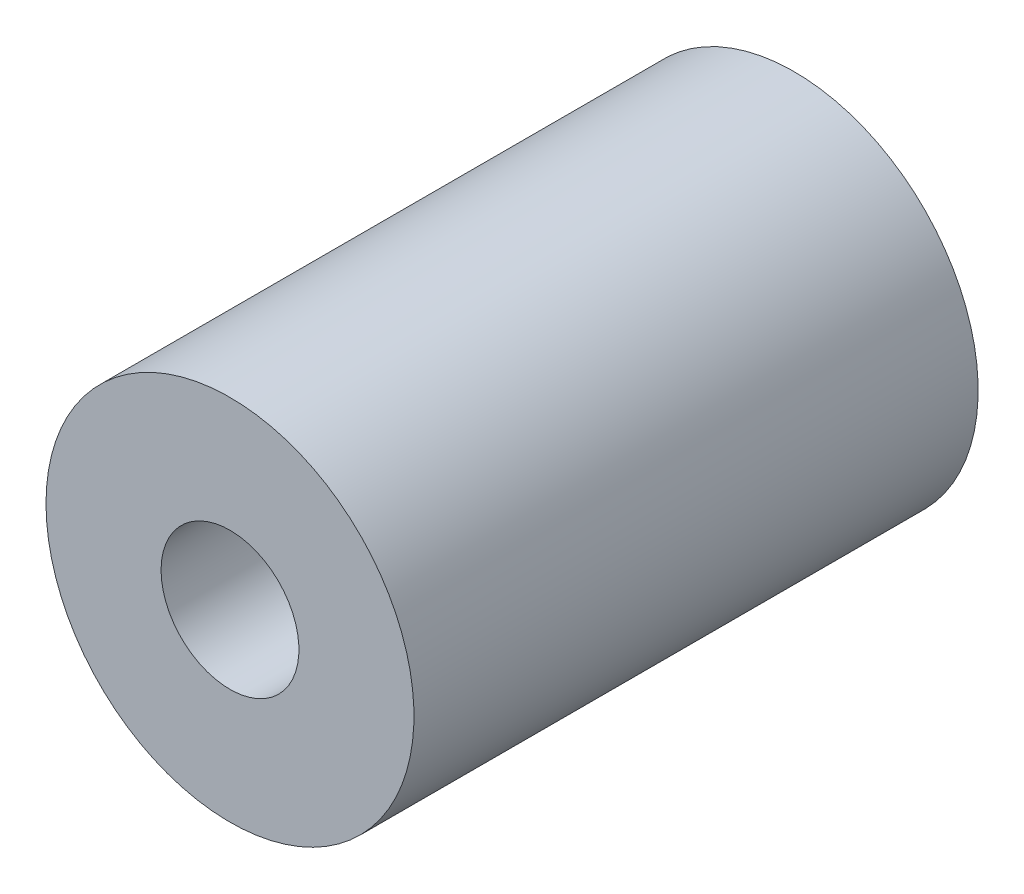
ISO-10303-21;
HEADER;
FILE_DESCRIPTION(('STEP AP214'),'2;1');
FILE_NAME('part.step','',(''),(''),'','','');
FILE_SCHEMA(('AUTOMOTIVE_DESIGN { 1 0 10303 214 1 1 1 1 }'));
ENDSEC;
DATA;
#1=APPLICATION_CONTEXT('core data for automotive mechanical design processes');
#2=APPLICATION_PROTOCOL_DEFINITION('international standard','automotive_design',2000,#1);
#3=PRODUCT_CONTEXT('',#1,'mechanical');
#4=PRODUCT('Part','Part','',(#3));
#5=PRODUCT_RELATED_PRODUCT_CATEGORY('part','',(#4));
#6=PRODUCT_DEFINITION_FORMATION('','',#4);
#7=PRODUCT_DEFINITION_CONTEXT('part definition',#1,'design');
#8=PRODUCT_DEFINITION('design','',#6,#7);
#9=PRODUCT_DEFINITION_SHAPE('','',#8);
#10=(LENGTH_UNIT() NAMED_UNIT(*) SI_UNIT(.MILLI.,.METRE.));
#11=(NAMED_UNIT(*) PLANE_ANGLE_UNIT() SI_UNIT($,.RADIAN.));
#12=(NAMED_UNIT(*) SI_UNIT($,.STERADIAN.) SOLID_ANGLE_UNIT());
#13=UNCERTAINTY_MEASURE_WITH_UNIT(LENGTH_MEASURE(1.E-05),#10,'distance_accuracy_value','');
#14=(GEOMETRIC_REPRESENTATION_CONTEXT(3) GLOBAL_UNCERTAINTY_ASSIGNED_CONTEXT((#13)) GLOBAL_UNIT_ASSIGNED_CONTEXT((#10,
#11,#12)) REPRESENTATION_CONTEXT('',''));
#15=CARTESIAN_POINT('',(0.,0.,0.));
#16=DIRECTION('',(0.,0.,1.));
#17=DIRECTION('',(1.,0.,0.));
#18=AXIS2_PLACEMENT_3D('',#15,#16,#17);
#19=CARTESIAN_POINT('',(0.,0.,29.21));
#20=DIRECTION('',(0.,0.,1.));
#21=DIRECTION('',(1.,0.,0.));
#22=AXIS2_PLACEMENT_3D('',#19,#20,#21);
#23=PLANE('',#22);
#24=CARTESIAN_POINT('',(0.,0.,29.21));
#25=DIRECTION('',(0.,0.,1.));
#26=DIRECTION('',(1.,0.,0.));
#27=AXIS2_PLACEMENT_3D('',#24,#25,#26);
#28=CIRCLE('',#27,9.525);
#29=CARTESIAN_POINT('',(-9.525,0.,29.21));
#30=VERTEX_POINT('',#29);
#31=EDGE_CURVE('E10',#30,#30,#28,.T.);
#32=ORIENTED_EDGE('',*,*,#31,.T.);
#33=EDGE_LOOP('',(#32));
#34=FACE_BOUND('',#33,.T.);
#35=CARTESIAN_POINT('',(0.,0.,29.21));
#36=DIRECTION('',(0.,0.,1.));
#37=DIRECTION('',(1.,0.,0.));
#38=AXIS2_PLACEMENT_3D('',#35,#36,#37);
#39=CIRCLE('',#38,3.5687);
#40=CARTESIAN_POINT('',(-3.5687,0.,29.21));
#41=VERTEX_POINT('',#40);
#42=EDGE_CURVE('E389',#41,#41,#39,.T.);
#43=ORIENTED_EDGE('',*,*,#42,.F.);
#44=EDGE_LOOP('',(#43));
#45=FACE_BOUND('',#44,.T.);
#46=ADVANCED_FACE('F378',(#34,#45),#23,.T.);
#47=CARTESIAN_POINT('',(0.,0.,0.));
#48=DIRECTION('',(0.,0.,1.));
#49=DIRECTION('',(1.,0.,0.));
#50=AXIS2_PLACEMENT_3D('',#47,#48,#49);
#51=PLANE('',#50);
#52=CARTESIAN_POINT('',(0.,0.,0.));
#53=DIRECTION('',(0.,0.,1.));
#54=DIRECTION('',(1.,0.,0.));
#55=AXIS2_PLACEMENT_3D('',#52,#53,#54);
#56=CIRCLE('',#55,9.525);
#57=CARTESIAN_POINT('',(-9.525,0.,0.));
#58=VERTEX_POINT('',#57);
#59=EDGE_CURVE('E385',#58,#58,#56,.T.);
#60=ORIENTED_EDGE('',*,*,#59,.F.);
#61=EDGE_LOOP('',(#60));
#62=FACE_BOUND('',#61,.T.);
#63=CARTESIAN_POINT('',(0.,0.,0.));
#64=DIRECTION('',(0.,0.,1.));
#65=DIRECTION('',(1.,0.,0.));
#66=AXIS2_PLACEMENT_3D('',#63,#64,#65);
#67=CIRCLE('',#66,3.5687);
#68=CARTESIAN_POINT('',(-3.5687,0.,0.));
#69=VERTEX_POINT('',#68);
#70=EDGE_CURVE('E393',#69,#69,#67,.T.);
#71=ORIENTED_EDGE('',*,*,#70,.T.);
#72=EDGE_LOOP('',(#71));
#73=FACE_BOUND('',#72,.T.);
#74=ADVANCED_FACE('F399',(#62,#73),#51,.F.);
#75=CARTESIAN_POINT('',(0.,0.,29.21));
#76=DIRECTION('',(0.,0.,-1.));
#77=DIRECTION('',(-1.,0.,0.));
#78=AXIS2_PLACEMENT_3D('',#75,#76,#77);
#79=CYLINDRICAL_SURFACE('',#78,9.525);
#80=CARTESIAN_POINT('',(-9.525,0.,29.21));
#81=CARTESIAN_POINT('',(-9.525,0.,28.9057291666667));
#82=CARTESIAN_POINT('',(-9.525,0.,28.6014583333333));
#83=CARTESIAN_POINT('',(-9.525,0.,27.9929166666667));
#84=CARTESIAN_POINT('',(-9.525,0.,27.6886458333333));
#85=CARTESIAN_POINT('',(-9.525,0.,27.0801041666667));
#86=CARTESIAN_POINT('',(-9.525,0.,26.7758333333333));
#87=CARTESIAN_POINT('',(-9.525,0.,26.1672916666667));
#88=CARTESIAN_POINT('',(-9.525,0.,25.8630208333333));
#89=CARTESIAN_POINT('',(-9.525,0.,25.2544791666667));
#90=CARTESIAN_POINT('',(-9.525,0.,24.9502083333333));
#91=CARTESIAN_POINT('',(-9.525,0.,24.3416666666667));
#92=CARTESIAN_POINT('',(-9.525,0.,24.0373958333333));
#93=CARTESIAN_POINT('',(-9.525,0.,23.4288541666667));
#94=CARTESIAN_POINT('',(-9.525,0.,23.1245833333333));
#95=CARTESIAN_POINT('',(-9.525,0.,22.5160416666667));
#96=CARTESIAN_POINT('',(-9.525,0.,22.2117708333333));
#97=CARTESIAN_POINT('',(-9.525,0.,21.6032291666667));
#98=CARTESIAN_POINT('',(-9.525,0.,21.2989583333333));
#99=CARTESIAN_POINT('',(-9.525,0.,20.6904166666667));
#100=CARTESIAN_POINT('',(-9.525,0.,20.3861458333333));
#101=CARTESIAN_POINT('',(-9.525,0.,19.7776041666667));
#102=CARTESIAN_POINT('',(-9.525,0.,19.4733333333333));
#103=CARTESIAN_POINT('',(-9.525,0.,18.8647916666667));
#104=CARTESIAN_POINT('',(-9.525,0.,18.5605208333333));
#105=CARTESIAN_POINT('',(-9.525,0.,17.9519791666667));
#106=CARTESIAN_POINT('',(-9.525,0.,17.6477083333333));
#107=CARTESIAN_POINT('',(-9.525,0.,17.0391666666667));
#108=CARTESIAN_POINT('',(-9.525,0.,16.7348958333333));
#109=CARTESIAN_POINT('',(-9.525,0.,16.1263541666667));
#110=CARTESIAN_POINT('',(-9.525,0.,15.8220833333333));
#111=CARTESIAN_POINT('',(-9.525,0.,15.2135416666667));
#112=CARTESIAN_POINT('',(-9.525,0.,14.9092708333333));
#113=CARTESIAN_POINT('',(-9.525,0.,14.3007291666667));
#114=CARTESIAN_POINT('',(-9.525,0.,13.9964583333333));
#115=CARTESIAN_POINT('',(-9.525,0.,13.3879166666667));
#116=CARTESIAN_POINT('',(-9.525,0.,13.0836458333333));
#117=CARTESIAN_POINT('',(-9.525,0.,12.4751041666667));
#118=CARTESIAN_POINT('',(-9.525,0.,12.1708333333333));
#119=CARTESIAN_POINT('',(-9.525,0.,11.5622916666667));
#120=CARTESIAN_POINT('',(-9.525,0.,11.2580208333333));
#121=CARTESIAN_POINT('',(-9.525,0.,10.6494791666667));
#122=CARTESIAN_POINT('',(-9.525,0.,10.3452083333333));
#123=CARTESIAN_POINT('',(-9.525,0.,9.73666666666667));
#124=CARTESIAN_POINT('',(-9.525,0.,9.43239583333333));
#125=CARTESIAN_POINT('',(-9.525,0.,8.82385416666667));
#126=CARTESIAN_POINT('',(-9.525,0.,8.51958333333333));
#127=CARTESIAN_POINT('',(-9.525,0.,7.91104166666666));
#128=CARTESIAN_POINT('',(-9.525,0.,7.60677083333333));
#129=CARTESIAN_POINT('',(-9.525,0.,6.99822916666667));
#130=CARTESIAN_POINT('',(-9.525,0.,6.69395833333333));
#131=CARTESIAN_POINT('',(-9.525,0.,6.08541666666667));
#132=CARTESIAN_POINT('',(-9.525,0.,5.78114583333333));
#133=CARTESIAN_POINT('',(-9.525,0.,5.17260416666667));
#134=CARTESIAN_POINT('',(-9.525,0.,4.86833333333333));
#135=CARTESIAN_POINT('',(-9.525,0.,4.25979166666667));
#136=CARTESIAN_POINT('',(-9.525,0.,3.95552083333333));
#137=CARTESIAN_POINT('',(-9.525,0.,3.34697916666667));
#138=CARTESIAN_POINT('',(-9.525,0.,3.04270833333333));
#139=CARTESIAN_POINT('',(-9.525,0.,2.43416666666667));
#140=CARTESIAN_POINT('',(-9.525,0.,2.12989583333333));
#141=CARTESIAN_POINT('',(-9.525,0.,1.52135416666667));
#142=CARTESIAN_POINT('',(-9.525,0.,1.21708333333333));
#143=CARTESIAN_POINT('',(-9.525,0.,0.608541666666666));
#144=CARTESIAN_POINT('',(-9.525,0.,0.304270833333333));
#145=CARTESIAN_POINT('',(-9.525,0.,0.));
#146=B_SPLINE_CURVE_WITH_KNOTS('',3,(#80,#81,#82,#83,#84,#85,#86,#87,#88,#89,#90,#91,#92,#93,
#94,#95,#96,#97,#98,#99,#100,#101,#102,#103,#104,#105,#106,#107,#108,#109,#110,#111,#112,#113,
#114,#115,#116,#117,#118,#119,#120,#121,#122,#123,#124,#125,#126,#127,#128,#129,#130,#131,#132,
#133,#134,#135,#136,#137,#138,#139,#140,#141,#142,#143,#144,#145),.UNSPECIFIED.,.F.,.F.,(4,2,2,
2,2,2,2,2,2,2,2,2,2,2,2,2,2,2,2,2,2,2,2,2,2,2,2,2,2,2,2,2,4),(0.,0.912812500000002,1.825625,
2.7384375,3.65125,4.5640625,5.476875,6.3896875,7.3025,8.2153125,9.128125,10.0409375,10.95375,
11.8665625,12.779375,13.6921875,14.605,15.5178125,16.430625,17.3434375,18.25625,19.1690625,
20.081875,20.9946875,21.9075,22.8203125,23.733125,24.6459375,25.55875,26.4715625,27.384375,
28.2971875,29.21),.UNSPECIFIED.);
#147=EDGE_CURVE('BSEAM380',#30,#58,#146,.T.);
#148=ORIENTED_EDGE('',*,*,#31,.F.);
#149=ORIENTED_EDGE('',*,*,#59,.T.);
#150=ORIENTED_EDGE('',*,*,#147,.T.);
#151=ORIENTED_EDGE('',*,*,#147,.F.);
#152=EDGE_LOOP('',(#148,#150,#149,#151));
#153=FACE_BOUND('',#152,.T.);
#154=ADVANCED_FACE('F380',(#153),#79,.T.);
#155=CARTESIAN_POINT('',(0.,0.,29.21));
#156=DIRECTION('',(0.,0.,-1.));
#157=DIRECTION('',(-1.,0.,0.));
#158=AXIS2_PLACEMENT_3D('',#155,#156,#157);
#159=CYLINDRICAL_SURFACE('',#158,3.5687);
#160=CARTESIAN_POINT('',(-3.5687,0.,29.21));
#161=CARTESIAN_POINT('',(-3.5687,0.,28.9057291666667));
#162=CARTESIAN_POINT('',(-3.5687,0.,28.6014583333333));
#163=CARTESIAN_POINT('',(-3.5687,0.,27.9929166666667));
#164=CARTESIAN_POINT('',(-3.5687,0.,27.6886458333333));
#165=CARTESIAN_POINT('',(-3.5687,0.,27.0801041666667));
#166=CARTESIAN_POINT('',(-3.5687,0.,26.7758333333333));
#167=CARTESIAN_POINT('',(-3.5687,0.,26.1672916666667));
#168=CARTESIAN_POINT('',(-3.5687,0.,25.8630208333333));
#169=CARTESIAN_POINT('',(-3.5687,0.,25.2544791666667));
#170=CARTESIAN_POINT('',(-3.5687,0.,24.9502083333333));
#171=CARTESIAN_POINT('',(-3.5687,0.,24.3416666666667));
#172=CARTESIAN_POINT('',(-3.5687,0.,24.0373958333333));
#173=CARTESIAN_POINT('',(-3.5687,0.,23.4288541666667));
#174=CARTESIAN_POINT('',(-3.5687,0.,23.1245833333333));
#175=CARTESIAN_POINT('',(-3.5687,0.,22.5160416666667));
#176=CARTESIAN_POINT('',(-3.5687,0.,22.2117708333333));
#177=CARTESIAN_POINT('',(-3.5687,0.,21.6032291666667));
#178=CARTESIAN_POINT('',(-3.5687,0.,21.2989583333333));
#179=CARTESIAN_POINT('',(-3.5687,0.,20.6904166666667));
#180=CARTESIAN_POINT('',(-3.5687,0.,20.3861458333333));
#181=CARTESIAN_POINT('',(-3.5687,0.,19.7776041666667));
#182=CARTESIAN_POINT('',(-3.5687,0.,19.4733333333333));
#183=CARTESIAN_POINT('',(-3.5687,0.,18.8647916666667));
#184=CARTESIAN_POINT('',(-3.5687,0.,18.5605208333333));
#185=CARTESIAN_POINT('',(-3.5687,0.,17.9519791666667));
#186=CARTESIAN_POINT('',(-3.5687,0.,17.6477083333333));
#187=CARTESIAN_POINT('',(-3.5687,0.,17.0391666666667));
#188=CARTESIAN_POINT('',(-3.5687,0.,16.7348958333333));
#189=CARTESIAN_POINT('',(-3.5687,0.,16.1263541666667));
#190=CARTESIAN_POINT('',(-3.5687,0.,15.8220833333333));
#191=CARTESIAN_POINT('',(-3.5687,0.,15.2135416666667));
#192=CARTESIAN_POINT('',(-3.5687,0.,14.9092708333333));
#193=CARTESIAN_POINT('',(-3.5687,0.,14.3007291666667));
#194=CARTESIAN_POINT('',(-3.5687,0.,13.9964583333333));
#195=CARTESIAN_POINT('',(-3.5687,0.,13.3879166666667));
#196=CARTESIAN_POINT('',(-3.5687,0.,13.0836458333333));
#197=CARTESIAN_POINT('',(-3.5687,0.,12.4751041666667));
#198=CARTESIAN_POINT('',(-3.5687,0.,12.1708333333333));
#199=CARTESIAN_POINT('',(-3.5687,0.,11.5622916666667));
#200=CARTESIAN_POINT('',(-3.5687,0.,11.2580208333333));
#201=CARTESIAN_POINT('',(-3.5687,0.,10.6494791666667));
#202=CARTESIAN_POINT('',(-3.5687,0.,10.3452083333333));
#203=CARTESIAN_POINT('',(-3.5687,0.,9.73666666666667));
#204=CARTESIAN_POINT('',(-3.5687,0.,9.43239583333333));
#205=CARTESIAN_POINT('',(-3.5687,0.,8.82385416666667));
#206=CARTESIAN_POINT('',(-3.5687,0.,8.51958333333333));
#207=CARTESIAN_POINT('',(-3.5687,0.,7.91104166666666));
#208=CARTESIAN_POINT('',(-3.5687,0.,7.60677083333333));
#209=CARTESIAN_POINT('',(-3.5687,0.,6.99822916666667));
#210=CARTESIAN_POINT('',(-3.5687,0.,6.69395833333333));
#211=CARTESIAN_POINT('',(-3.5687,0.,6.08541666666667));
#212=CARTESIAN_POINT('',(-3.5687,0.,5.78114583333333));
#213=CARTESIAN_POINT('',(-3.5687,0.,5.17260416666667));
#214=CARTESIAN_POINT('',(-3.5687,0.,4.86833333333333));
#215=CARTESIAN_POINT('',(-3.5687,0.,4.25979166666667));
#216=CARTESIAN_POINT('',(-3.5687,0.,3.95552083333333));
#217=CARTESIAN_POINT('',(-3.5687,0.,3.34697916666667));
#218=CARTESIAN_POINT('',(-3.5687,0.,3.04270833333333));
#219=CARTESIAN_POINT('',(-3.5687,0.,2.43416666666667));
#220=CARTESIAN_POINT('',(-3.5687,0.,2.12989583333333));
#221=CARTESIAN_POINT('',(-3.5687,0.,1.52135416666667));
#222=CARTESIAN_POINT('',(-3.5687,0.,1.21708333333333));
#223=CARTESIAN_POINT('',(-3.5687,0.,0.608541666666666));
#224=CARTESIAN_POINT('',(-3.5687,0.,0.304270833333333));
#225=CARTESIAN_POINT('',(-3.5687,0.,0.));
#226=B_SPLINE_CURVE_WITH_KNOTS('',3,(#160,#161,#162,#163,#164,#165,#166,#167,#168,#169,#170,
#171,#172,#173,#174,#175,#176,#177,#178,#179,#180,#181,#182,#183,#184,#185,#186,#187,#188,#189,
#190,#191,#192,#193,#194,#195,#196,#197,#198,#199,#200,#201,#202,#203,#204,#205,#206,#207,#208,
#209,#210,#211,#212,#213,#214,#215,#216,#217,#218,#219,#220,#221,#222,#223,#224,#225),
.UNSPECIFIED.,.F.,.F.,(4,2,2,2,2,2,2,2,2,2,2,2,2,2,2,2,2,2,2,2,2,2,2,2,2,2,2,2,2,2,2,2,4),(0.,
0.912812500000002,1.825625,2.7384375,3.65125,4.5640625,5.476875,6.3896875,7.3025,8.2153125,
9.128125,10.0409375,10.95375,11.8665625,12.779375,13.6921875,14.605,15.5178125,16.430625,
17.3434375,18.25625,19.1690625,20.081875,20.9946875,21.9075,22.8203125,23.733125,24.6459375,
25.55875,26.4715625,27.384375,28.2971875,29.21),.UNSPECIFIED.);
#227=EDGE_CURVE('BSEAM401',#41,#69,#226,.T.);
#228=ORIENTED_EDGE('',*,*,#42,.T.);
#229=ORIENTED_EDGE('',*,*,#70,.F.);
#230=ORIENTED_EDGE('',*,*,#227,.T.);
#231=ORIENTED_EDGE('',*,*,#227,.F.);
#232=EDGE_LOOP('',(#228,#230,#229,#231));
#233=FACE_BOUND('',#232,.T.);
#234=ADVANCED_FACE('F401',(#233),#159,.F.);
#235=CLOSED_SHELL('',(#46,#74,#154,#234));
#236=MANIFOLD_SOLID_BREP('B2',#235);
#237=ADVANCED_BREP_SHAPE_REPRESENTATION('',(#18,#236),#14);
#238=SHAPE_DEFINITION_REPRESENTATION(#9,#237);
ENDSEC;
END-ISO-10303-21;
